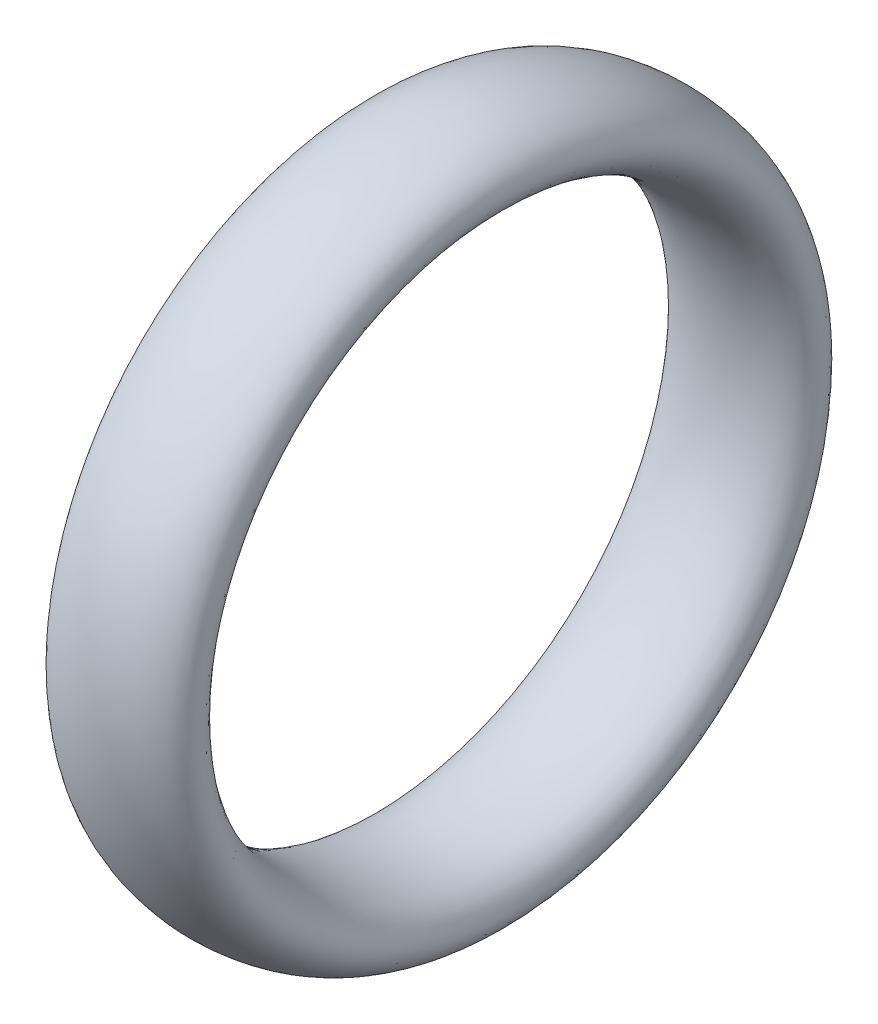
from build123d import *

# Parameters (mm, degrees)
SKETCH1_RX = 1.143
SKETCH1_RY = 0.60325


with BuildPart() as part:
    # Sketch1 → Base-Revolve (revolve)
    with BuildSketch(Plane.XY):
        with Locations((-1.143, 4.92125)):
            Ellipse(SKETCH1_RX, SKETCH1_RY)
    revolve(axis=Axis((1.052152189, 0, 0), (-1, 0, 0)))


solid = part.part
